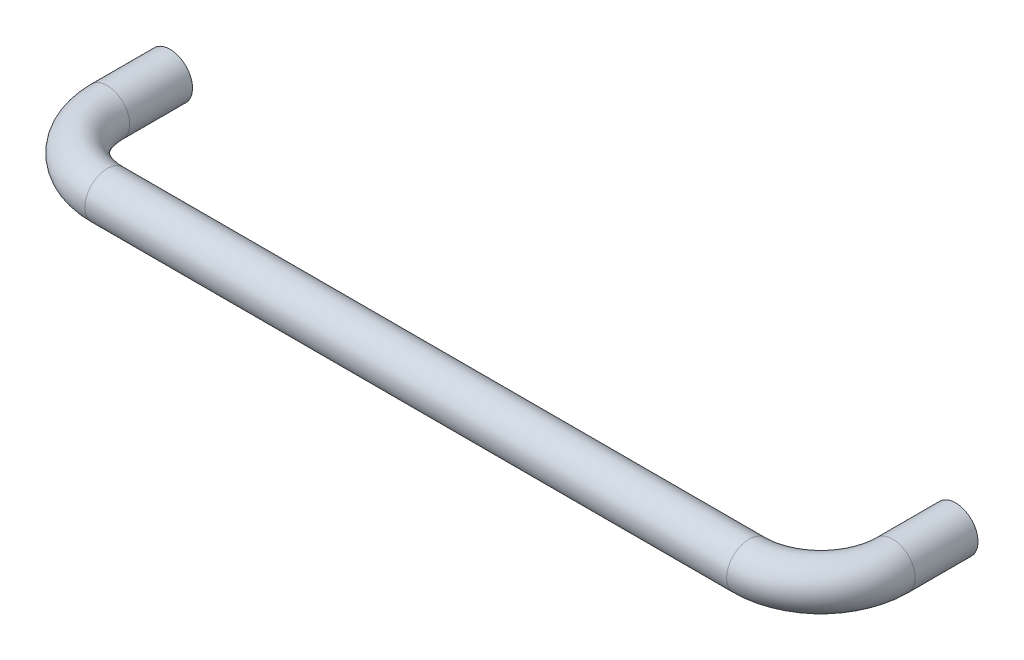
ISO-10303-21;
HEADER;
FILE_DESCRIPTION(('STEP AP214'),'2;1');
FILE_NAME('part.step','',(''),(''),'','','');
FILE_SCHEMA(('AUTOMOTIVE_DESIGN { 1 0 10303 214 1 1 1 1 }'));
ENDSEC;
DATA;
#1=APPLICATION_CONTEXT('core data for automotive mechanical design processes');
#2=APPLICATION_PROTOCOL_DEFINITION('international standard','automotive_design',2000,#1);
#3=PRODUCT_CONTEXT('',#1,'mechanical');
#4=PRODUCT('Part','Part','',(#3));
#5=PRODUCT_RELATED_PRODUCT_CATEGORY('part','',(#4));
#6=PRODUCT_DEFINITION_FORMATION('','',#4);
#7=PRODUCT_DEFINITION_CONTEXT('part definition',#1,'design');
#8=PRODUCT_DEFINITION('design','',#6,#7);
#9=PRODUCT_DEFINITION_SHAPE('','',#8);
#10=(LENGTH_UNIT() NAMED_UNIT(*) SI_UNIT(.MILLI.,.METRE.));
#11=(NAMED_UNIT(*) PLANE_ANGLE_UNIT() SI_UNIT($,.RADIAN.));
#12=(NAMED_UNIT(*) SI_UNIT($,.STERADIAN.) SOLID_ANGLE_UNIT());
#13=UNCERTAINTY_MEASURE_WITH_UNIT(LENGTH_MEASURE(1.E-05),#10,'distance_accuracy_value','');
#14=(GEOMETRIC_REPRESENTATION_CONTEXT(3) GLOBAL_UNCERTAINTY_ASSIGNED_CONTEXT((#13)) GLOBAL_UNIT_ASSIGNED_CONTEXT((#10,
#11,#12)) REPRESENTATION_CONTEXT('',''));
#15=CARTESIAN_POINT('',(0.,0.,0.));
#16=DIRECTION('',(0.,0.,1.));
#17=DIRECTION('',(1.,0.,0.));
#18=AXIS2_PLACEMENT_3D('',#15,#16,#17);
#19=CARTESIAN_POINT('',(349.992502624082,0.,28.));
#20=DIRECTION('',(0.,0.,-1.));
#21=DIRECTION('',(0.,1.,0.));
#22=AXIS2_PLACEMENT_3D('',#19,#20,#21);
#23=CYLINDRICAL_SURFACE('',#22,10.);
#24=CARTESIAN_POINT('',(349.992502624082,0.,28.));
#25=DIRECTION('',(0.,0.,-1.));
#26=DIRECTION('',(0.,-1.,0.));
#27=AXIS2_PLACEMENT_3D('',#24,#25,#26);
#28=CIRCLE('',#27,10.);
#29=CARTESIAN_POINT('',(359.992502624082,0.,28.));
#30=VERTEX_POINT('',#29);
#31=EDGE_CURVE('E18',#30,#30,#28,.T.);
#32=ORIENTED_EDGE('',*,*,#31,.T.);
#33=EDGE_LOOP('',(#32));
#34=FACE_BOUND('',#33,.T.);
#35=CARTESIAN_POINT('',(349.992502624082,0.,0.));
#36=DIRECTION('',(0.,0.,-1.));
#37=DIRECTION('',(0.,-1.,0.));
#38=AXIS2_PLACEMENT_3D('',#35,#36,#37);
#39=CIRCLE('',#38,10.);
#40=CARTESIAN_POINT('',(349.992502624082,-9.99999999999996,0.));
#41=VERTEX_POINT('',#40);
#42=EDGE_CURVE('E8',#41,#41,#39,.T.);
#43=ORIENTED_EDGE('',*,*,#42,.F.);
#44=EDGE_LOOP('',(#43));
#45=FACE_BOUND('',#44,.T.);
#46=ADVANCED_FACE('F12',(#34,#45),#23,.T.);
#47=CARTESIAN_POINT('',(317.992502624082,0.,28.));
#48=DIRECTION('',(0.,1.,0.));
#49=DIRECTION('',(-1.,0.,0.));
#50=AXIS2_PLACEMENT_3D('',#47,#48,#49);
#51=TOROIDAL_SURFACE('',#50,32.,10.);
#52=CARTESIAN_POINT('',(317.992502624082,0.,60.));
#53=DIRECTION('',(1.,0.,0.));
#54=DIRECTION('',(0.,-1.,0.));
#55=AXIS2_PLACEMENT_3D('',#52,#53,#54);
#56=CIRCLE('',#55,10.);
#57=CARTESIAN_POINT('',(317.992502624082,0.,70.));
#58=VERTEX_POINT('',#57);
#59=EDGE_CURVE('E22',#58,#58,#56,.T.);
#60=CARTESIAN_POINT('',(317.992502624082,0.,28.));
#61=DIRECTION('',(0.,1.,0.));
#62=DIRECTION('',(-1.,0.,0.));
#63=AXIS2_PLACEMENT_3D('',#60,#61,#62);
#64=CIRCLE('',#63,42.);
#65=EDGE_CURVE('',#58,#30,#64,.T.);
#66=ORIENTED_EDGE('',*,*,#59,.T.);
#67=ORIENTED_EDGE('',*,*,#31,.F.);
#68=ORIENTED_EDGE('',*,*,#65,.T.);
#69=ORIENTED_EDGE('',*,*,#65,.F.);
#70=EDGE_LOOP('',(#66,#68,#67,#69));
#71=FACE_BOUND('',#70,.T.);
#72=ADVANCED_FACE('F81',(#71),#51,.T.);
#73=CARTESIAN_POINT('',(31.9925026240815,0.,60.));
#74=DIRECTION('',(1.,0.,0.));
#75=DIRECTION('',(0.,0.,1.));
#76=AXIS2_PLACEMENT_3D('',#73,#74,#75);
#77=CYLINDRICAL_SURFACE('',#76,10.);
#78=CARTESIAN_POINT('',(31.9925026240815,0.,60.));
#79=DIRECTION('',(1.,0.,0.));
#80=DIRECTION('',(0.,-1.,0.));
#81=AXIS2_PLACEMENT_3D('',#78,#79,#80);
#82=CIRCLE('',#81,10.);
#83=CARTESIAN_POINT('',(31.9925026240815,0.,70.));
#84=VERTEX_POINT('',#83);
#85=EDGE_CURVE('E26',#84,#84,#82,.T.);
#86=ORIENTED_EDGE('',*,*,#85,.T.);
#87=EDGE_LOOP('',(#86));
#88=FACE_BOUND('',#87,.T.);
#89=ORIENTED_EDGE('',*,*,#59,.F.);
#90=EDGE_LOOP('',(#89));
#91=FACE_BOUND('',#90,.T.);
#92=ADVANCED_FACE('F77',(#88,#91),#77,.T.);
#93=CARTESIAN_POINT('',(31.9925026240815,0.,28.));
#94=DIRECTION('',(0.,1.,0.));
#95=DIRECTION('',(-1.,0.,0.));
#96=AXIS2_PLACEMENT_3D('',#93,#94,#95);
#97=TOROIDAL_SURFACE('',#96,32.,10.);
#98=CARTESIAN_POINT('',(-0.00749737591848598,0.,28.));
#99=DIRECTION('',(0.,0.,1.));
#100=DIRECTION('',(0.,-1.,0.));
#101=AXIS2_PLACEMENT_3D('',#98,#99,#100);
#102=CIRCLE('',#101,10.);
#103=CARTESIAN_POINT('',(-10.0074973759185,0.,28.));
#104=VERTEX_POINT('',#103);
#105=EDGE_CURVE('E31',#104,#104,#102,.T.);
#106=CARTESIAN_POINT('',(31.9925026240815,0.,28.));
#107=DIRECTION('',(0.,1.,0.));
#108=DIRECTION('',(-1.,0.,0.));
#109=AXIS2_PLACEMENT_3D('',#106,#107,#108);
#110=CIRCLE('',#109,42.);
#111=EDGE_CURVE('',#104,#84,#110,.T.);
#112=ORIENTED_EDGE('',*,*,#105,.T.);
#113=ORIENTED_EDGE('',*,*,#85,.F.);
#114=ORIENTED_EDGE('',*,*,#111,.T.);
#115=ORIENTED_EDGE('',*,*,#111,.F.);
#116=EDGE_LOOP('',(#112,#114,#113,#115));
#117=FACE_BOUND('',#116,.T.);
#118=ADVANCED_FACE('F64',(#117),#97,.T.);
#119=CARTESIAN_POINT('',(-0.00749737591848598,0.,28.));
#120=DIRECTION('',(0.,0.,-1.));
#121=DIRECTION('',(0.,1.,0.));
#122=AXIS2_PLACEMENT_3D('',#119,#120,#121);
#123=CYLINDRICAL_SURFACE('',#122,10.);
#124=ORIENTED_EDGE('',*,*,#105,.F.);
#125=EDGE_LOOP('',(#124));
#126=FACE_BOUND('',#125,.T.);
#127=CARTESIAN_POINT('',(-0.00749737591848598,0.,0.));
#128=DIRECTION('',(0.,0.,1.));
#129=DIRECTION('',(0.,-1.,0.));
#130=AXIS2_PLACEMENT_3D('',#127,#128,#129);
#131=CIRCLE('',#130,10.);
#132=CARTESIAN_POINT('',(-0.00749737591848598,-9.99999999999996,0.));
#133=VERTEX_POINT('',#132);
#134=EDGE_CURVE('E34',#133,#133,#131,.T.);
#135=ORIENTED_EDGE('',*,*,#134,.T.);
#136=EDGE_LOOP('',(#135));
#137=FACE_BOUND('',#136,.T.);
#138=ADVANCED_FACE('F62',(#126,#137),#123,.T.);
#139=CARTESIAN_POINT('',(349.992502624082,0.,0.));
#140=DIRECTION('',(0.,0.,-1.));
#141=DIRECTION('',(0.,-1.,0.));
#142=AXIS2_PLACEMENT_3D('',#139,#140,#141);
#143=PLANE('',#142);
#144=CARTESIAN_POINT('',(349.985005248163,0.,0.));
#145=DIRECTION('',(0.,0.,-1.));
#146=DIRECTION('',(0.,-1.,0.));
#147=AXIS2_PLACEMENT_3D('',#144,#145,#146);
#148=CIRCLE('',#147,4.53099737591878);
#149=CARTESIAN_POINT('',(349.985005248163,-4.53099737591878,0.));
#150=VERTEX_POINT('',#149);
#151=EDGE_CURVE('E52',#150,#150,#148,.T.);
#152=ORIENTED_EDGE('',*,*,#151,.F.);
#153=EDGE_LOOP('',(#152));
#154=FACE_BOUND('',#153,.T.);
#155=ORIENTED_EDGE('',*,*,#42,.T.);
#156=EDGE_LOOP('',(#155));
#157=FACE_BOUND('',#156,.T.);
#158=ADVANCED_FACE('F59',(#154,#157),#143,.T.);
#159=CARTESIAN_POINT('',(-0.00749737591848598,0.,0.));
#160=DIRECTION('',(0.,0.,1.));
#161=DIRECTION('',(0.,-1.,0.));
#162=AXIS2_PLACEMENT_3D('',#159,#160,#161);
#163=PLANE('',#162);
#164=CARTESIAN_POINT('',(0.,0.,0.));
#165=DIRECTION('',(0.,0.,1.));
#166=DIRECTION('',(0.,-1.,0.));
#167=AXIS2_PLACEMENT_3D('',#164,#165,#166);
#168=CIRCLE('',#167,4.53099737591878);
#169=CARTESIAN_POINT('',(0.,-4.53099737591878,0.));
#170=VERTEX_POINT('',#169);
#171=EDGE_CURVE('E43',#170,#170,#168,.T.);
#172=ORIENTED_EDGE('',*,*,#171,.T.);
#173=EDGE_LOOP('',(#172));
#174=FACE_BOUND('',#173,.T.);
#175=ORIENTED_EDGE('',*,*,#134,.F.);
#176=EDGE_LOOP('',(#175));
#177=FACE_BOUND('',#176,.T.);
#178=ADVANCED_FACE('F61',(#174,#177),#163,.F.);
#179=CARTESIAN_POINT('',(-4.,0.,15.));
#180=DIRECTION('',(0.,0.,-1.));
#181=DIRECTION('',(0.,1.,0.));
#182=AXIS2_PLACEMENT_3D('',#179,#180,#181);
#183=PLANE('',#182);
#184=CARTESIAN_POINT('',(0.,0.,15.));
#185=DIRECTION('',(0.,0.,1.));
#186=DIRECTION('',(0.,-1.,0.));
#187=AXIS2_PLACEMENT_3D('',#184,#185,#186);
#188=CIRCLE('',#187,4.00000000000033);
#189=CARTESIAN_POINT('',(0.,-4.00000000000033,15.));
#190=VERTEX_POINT('',#189);
#191=EDGE_CURVE('E37',#190,#190,#188,.T.);
#192=ORIENTED_EDGE('',*,*,#191,.F.);
#193=EDGE_LOOP('',(#192));
#194=FACE_BOUND('',#193,.T.);
#195=ADVANCED_FACE('F71',(#194),#183,.T.);
#196=CARTESIAN_POINT('',(0.,0.,28.0149947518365));
#197=DIRECTION('',(0.,0.,1.));
#198=DIRECTION('',(0.,-1.,0.));
#199=AXIS2_PLACEMENT_3D('',#196,#197,#198);
#200=CYLINDRICAL_SURFACE('',#199,4.00000000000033);
#201=ORIENTED_EDGE('',*,*,#191,.T.);
#202=EDGE_LOOP('',(#201));
#203=FACE_BOUND('',#202,.T.);
#204=CARTESIAN_POINT('',(0.,0.,0.530997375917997));
#205=DIRECTION('',(0.,0.,1.));
#206=DIRECTION('',(0.,-1.,0.));
#207=AXIS2_PLACEMENT_3D('',#204,#205,#206);
#208=CIRCLE('',#207,4.00000000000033);
#209=CARTESIAN_POINT('',(0.,-4.00000000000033,0.530997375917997));
#210=VERTEX_POINT('',#209);
#211=EDGE_CURVE('E40',#210,#210,#208,.T.);
#212=ORIENTED_EDGE('',*,*,#211,.F.);
#213=EDGE_LOOP('',(#212));
#214=FACE_BOUND('',#213,.T.);
#215=ADVANCED_FACE('F137',(#203,#214),#200,.F.);
#216=CARTESIAN_POINT('',(0.,0.,0.530997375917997));
#217=DIRECTION('',(0.,0.,-1.));
#218=DIRECTION('',(0.,1.,0.));
#219=AXIS2_PLACEMENT_3D('',#216,#217,#218);
#220=CONICAL_SURFACE('',#219,4.00000000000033,0.7853981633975);
#221=ORIENTED_EDGE('',*,*,#171,.F.);
#222=EDGE_LOOP('',(#221));
#223=FACE_BOUND('',#222,.T.);
#224=ORIENTED_EDGE('',*,*,#211,.T.);
#225=EDGE_LOOP('',(#224));
#226=FACE_BOUND('',#225,.T.);
#227=ADVANCED_FACE('F145',(#223,#226),#220,.F.);
#228=CARTESIAN_POINT('',(353.985005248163,0.,15.));
#229=DIRECTION('',(0.,0.,-1.));
#230=DIRECTION('',(0.,1.,0.));
#231=AXIS2_PLACEMENT_3D('',#228,#229,#230);
#232=PLANE('',#231);
#233=CARTESIAN_POINT('',(349.985005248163,0.,15.));
#234=DIRECTION('',(0.,0.,-1.));
#235=DIRECTION('',(0.,-1.,0.));
#236=AXIS2_PLACEMENT_3D('',#233,#234,#235);
#237=CIRCLE('',#236,4.00000000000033);
#238=CARTESIAN_POINT('',(349.985005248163,-4.00000000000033,15.));
#239=VERTEX_POINT('',#238);
#240=EDGE_CURVE('E46',#239,#239,#237,.T.);
#241=ORIENTED_EDGE('',*,*,#240,.T.);
#242=EDGE_LOOP('',(#241));
#243=FACE_BOUND('',#242,.T.);
#244=ADVANCED_FACE('F154',(#243),#232,.T.);
#245=CARTESIAN_POINT('',(349.985005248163,0.,28.0149947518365));
#246=DIRECTION('',(0.,0.,1.));
#247=DIRECTION('',(0.,-1.,0.));
#248=AXIS2_PLACEMENT_3D('',#245,#246,#247);
#249=CYLINDRICAL_SURFACE('',#248,4.00000000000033);
#250=ORIENTED_EDGE('',*,*,#240,.F.);
#251=EDGE_LOOP('',(#250));
#252=FACE_BOUND('',#251,.T.);
#253=CARTESIAN_POINT('',(349.985005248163,0.,0.530997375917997));
#254=DIRECTION('',(0.,0.,-1.));
#255=DIRECTION('',(0.,-1.,0.));
#256=AXIS2_PLACEMENT_3D('',#253,#254,#255);
#257=CIRCLE('',#256,4.00000000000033);
#258=CARTESIAN_POINT('',(349.985005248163,-4.00000000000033,0.530997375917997));
#259=VERTEX_POINT('',#258);
#260=EDGE_CURVE('E49',#259,#259,#257,.T.);
#261=ORIENTED_EDGE('',*,*,#260,.T.);
#262=EDGE_LOOP('',(#261));
#263=FACE_BOUND('',#262,.T.);
#264=ADVANCED_FACE('F163',(#252,#263),#249,.F.);
#265=CARTESIAN_POINT('',(349.985005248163,0.,0.530997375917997));
#266=DIRECTION('',(0.,0.,-1.));
#267=DIRECTION('',(0.,1.,0.));
#268=AXIS2_PLACEMENT_3D('',#265,#266,#267);
#269=CONICAL_SURFACE('',#268,4.00000000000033,0.7853981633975);
#270=ORIENTED_EDGE('',*,*,#151,.T.);
#271=EDGE_LOOP('',(#270));
#272=FACE_BOUND('',#271,.T.);
#273=ORIENTED_EDGE('',*,*,#260,.F.);
#274=EDGE_LOOP('',(#273));
#275=FACE_BOUND('',#274,.T.);
#276=ADVANCED_FACE('F56',(#272,#275),#269,.F.);
#277=CLOSED_SHELL('',(#46,#72,#92,#118,#138,#158,#178,#195,#215,#227,#244,#264,#276));
#278=MANIFOLD_SOLID_BREP('B1',#277);
#279=ADVANCED_BREP_SHAPE_REPRESENTATION('',(#18,#278),#14);
#280=SHAPE_DEFINITION_REPRESENTATION(#9,#279);
ENDSEC;
END-ISO-10303-21;
